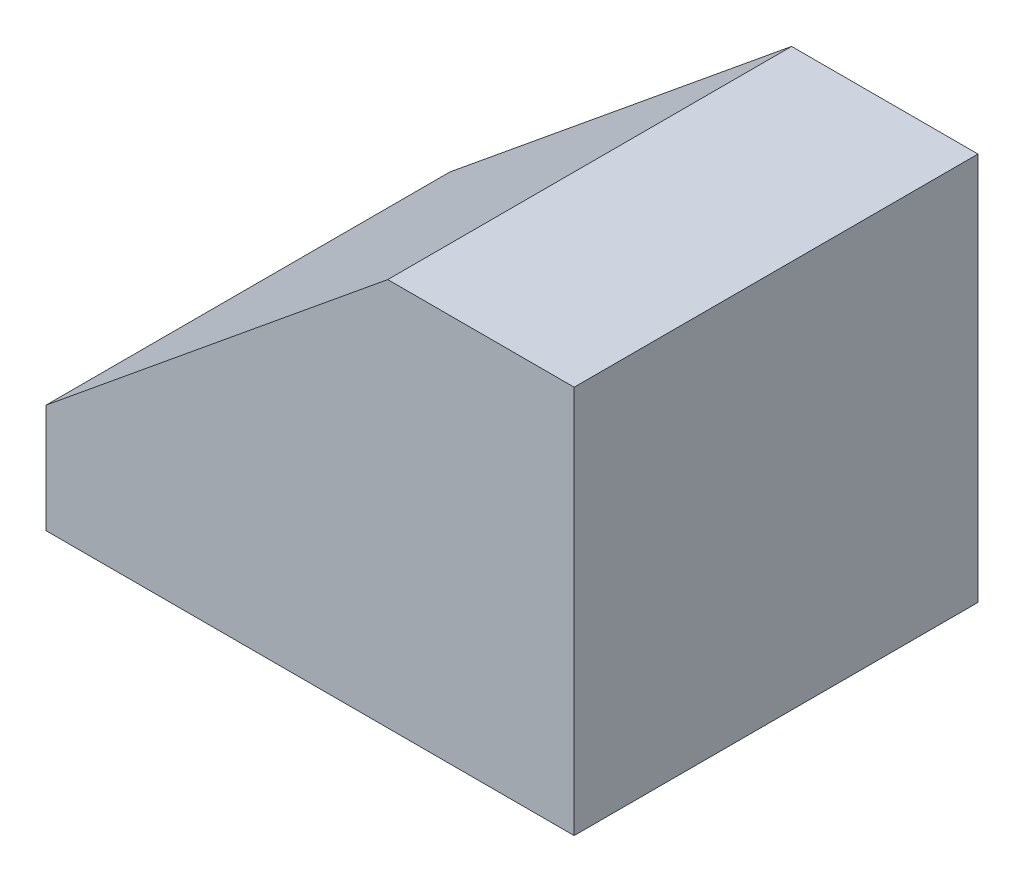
ISO-10303-21;
HEADER;
FILE_DESCRIPTION(('STEP AP214'),'2;1');
FILE_NAME('part.step','',(''),(''),'','','');
FILE_SCHEMA(('AUTOMOTIVE_DESIGN { 1 0 10303 214 1 1 1 1 }'));
ENDSEC;
DATA;
#1=APPLICATION_CONTEXT('core data for automotive mechanical design processes');
#2=APPLICATION_PROTOCOL_DEFINITION('international standard','automotive_design',2000,#1);
#3=PRODUCT_CONTEXT('',#1,'mechanical');
#4=PRODUCT('Part','Part','',(#3));
#5=PRODUCT_RELATED_PRODUCT_CATEGORY('part','',(#4));
#6=PRODUCT_DEFINITION_FORMATION('','',#4);
#7=PRODUCT_DEFINITION_CONTEXT('part definition',#1,'design');
#8=PRODUCT_DEFINITION('design','',#6,#7);
#9=PRODUCT_DEFINITION_SHAPE('','',#8);
#10=(LENGTH_UNIT() NAMED_UNIT(*) SI_UNIT(.MILLI.,.METRE.));
#11=(NAMED_UNIT(*) PLANE_ANGLE_UNIT() SI_UNIT($,.RADIAN.));
#12=(NAMED_UNIT(*) SI_UNIT($,.STERADIAN.) SOLID_ANGLE_UNIT());
#13=UNCERTAINTY_MEASURE_WITH_UNIT(LENGTH_MEASURE(1.E-05),#10,'distance_accuracy_value','');
#14=(GEOMETRIC_REPRESENTATION_CONTEXT(3) GLOBAL_UNCERTAINTY_ASSIGNED_CONTEXT((#13)) GLOBAL_UNIT_ASSIGNED_CONTEXT((#10,
#11,#12)) REPRESENTATION_CONTEXT('',''));
#15=CARTESIAN_POINT('',(0.,0.,0.));
#16=DIRECTION('',(0.,0.,1.));
#17=DIRECTION('',(1.,0.,0.));
#18=AXIS2_PLACEMENT_3D('',#15,#16,#17);
#19=CARTESIAN_POINT('',(0.,50.,0.));
#20=DIRECTION('',(0.,0.,1.));
#21=DIRECTION('',(1.,0.,0.));
#22=AXIS2_PLACEMENT_3D('',#19,#20,#21);
#23=PLANE('',#22);
#24=DIRECTION('',(0.773957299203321,0.633237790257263,0.));
#25=VECTOR('',#24,1.);
#26=CARTESIAN_POINT('',(-24.,50.,0.));
#27=LINE('',#26,#25);
#28=CARTESIAN_POINT('',(-68.,14.,0.));
#29=VERTEX_POINT('',#28);
#30=CARTESIAN_POINT('',(-24.,50.,0.));
#31=VERTEX_POINT('',#30);
#32=EDGE_CURVE('E115',#29,#31,#27,.T.);
#33=ORIENTED_EDGE('',*,*,#32,.T.);
#34=DIRECTION('',(-1.,0.,0.));
#35=VECTOR('',#34,1.);
#36=CARTESIAN_POINT('',(0.,50.,0.));
#37=LINE('',#36,#35);
#38=CARTESIAN_POINT('',(0.,50.,0.));
#39=VERTEX_POINT('',#38);
#40=EDGE_CURVE('E112',#39,#31,#37,.T.);
#41=ORIENTED_EDGE('',*,*,#40,.F.);
#42=DIRECTION('',(0.,-1.,0.));
#43=VECTOR('',#42,1.);
#44=CARTESIAN_POINT('',(0.,50.,0.));
#45=LINE('',#44,#43);
#46=CARTESIAN_POINT('',(0.,0.,0.));
#47=VERTEX_POINT('',#46);
#48=EDGE_CURVE('E11',#39,#47,#45,.T.);
#49=ORIENTED_EDGE('',*,*,#48,.T.);
#50=DIRECTION('',(-1.,0.,0.));
#51=VECTOR('',#50,1.);
#52=CARTESIAN_POINT('',(0.,0.,0.));
#53=LINE('',#52,#51);
#54=CARTESIAN_POINT('',(-68.,0.,0.));
#55=VERTEX_POINT('',#54);
#56=EDGE_CURVE('E94',#47,#55,#53,.T.);
#57=ORIENTED_EDGE('',*,*,#56,.T.);
#58=DIRECTION('',(0.,-1.,0.));
#59=VECTOR('',#58,1.);
#60=CARTESIAN_POINT('',(-68.,50.,0.));
#61=LINE('',#60,#59);
#62=EDGE_CURVE('E39',#29,#55,#61,.T.);
#63=ORIENTED_EDGE('',*,*,#62,.F.);
#64=EDGE_LOOP('',(#33,#41,#49,#57,#63));
#65=FACE_BOUND('',#64,.T.);
#66=ADVANCED_FACE('F31',(#65),#23,.F.);
#67=CARTESIAN_POINT('',(-68.,50.,0.));
#68=DIRECTION('',(1.,0.,0.));
#69=DIRECTION('',(0.,0.,-1.));
#70=AXIS2_PLACEMENT_3D('',#67,#68,#69);
#71=PLANE('',#70);
#72=DIRECTION('',(0.,0.,-1.));
#73=VECTOR('',#72,1.);
#74=CARTESIAN_POINT('',(-68.,14.,52.));
#75=LINE('',#74,#73);
#76=CARTESIAN_POINT('',(-68.,14.,52.));
#77=VERTEX_POINT('',#76);
#78=EDGE_CURVE('E95',#77,#29,#75,.T.);
#79=ORIENTED_EDGE('',*,*,#78,.T.);
#80=ORIENTED_EDGE('',*,*,#62,.T.);
#81=DIRECTION('',(0.,0.,1.));
#82=VECTOR('',#81,1.);
#83=CARTESIAN_POINT('',(-68.,0.,0.));
#84=LINE('',#83,#82);
#85=CARTESIAN_POINT('',(-68.,0.,52.));
#86=VERTEX_POINT('',#85);
#87=EDGE_CURVE('E85',#55,#86,#84,.T.);
#88=ORIENTED_EDGE('',*,*,#87,.T.);
#89=DIRECTION('',(0.,-1.,0.));
#90=VECTOR('',#89,1.);
#91=CARTESIAN_POINT('',(-68.,50.,52.));
#92=LINE('',#91,#90);
#93=EDGE_CURVE('E79',#77,#86,#92,.T.);
#94=ORIENTED_EDGE('',*,*,#93,.F.);
#95=EDGE_LOOP('',(#79,#80,#88,#94));
#96=FACE_BOUND('',#95,.T.);
#97=ADVANCED_FACE('F107',(#96),#71,.F.);
#98=CARTESIAN_POINT('',(-68.,50.,52.));
#99=DIRECTION('',(0.,0.,-1.));
#100=DIRECTION('',(-1.,0.,0.));
#101=AXIS2_PLACEMENT_3D('',#98,#99,#100);
#102=PLANE('',#101);
#103=DIRECTION('',(0.773957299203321,0.633237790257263,0.));
#104=VECTOR('',#103,1.);
#105=CARTESIAN_POINT('',(-24.,50.,52.));
#106=LINE('',#105,#104);
#107=CARTESIAN_POINT('',(-24.,50.,52.));
#108=VERTEX_POINT('',#107);
#109=EDGE_CURVE('E46',#77,#108,#106,.T.);
#110=ORIENTED_EDGE('',*,*,#109,.F.);
#111=ORIENTED_EDGE('',*,*,#93,.T.);
#112=DIRECTION('',(1.,0.,0.));
#113=VECTOR('',#112,1.);
#114=CARTESIAN_POINT('',(-68.,0.,52.));
#115=LINE('',#114,#113);
#116=CARTESIAN_POINT('',(0.,0.,52.));
#117=VERTEX_POINT('',#116);
#118=EDGE_CURVE('E73',#86,#117,#115,.T.);
#119=ORIENTED_EDGE('',*,*,#118,.T.);
#120=DIRECTION('',(0.,-1.,0.));
#121=VECTOR('',#120,1.);
#122=CARTESIAN_POINT('',(0.,50.,52.));
#123=LINE('',#122,#121);
#124=CARTESIAN_POINT('',(0.,50.,52.));
#125=VERTEX_POINT('',#124);
#126=EDGE_CURVE('E76',#125,#117,#123,.T.);
#127=ORIENTED_EDGE('',*,*,#126,.F.);
#128=DIRECTION('',(1.,0.,0.));
#129=VECTOR('',#128,1.);
#130=CARTESIAN_POINT('',(-68.,50.,52.));
#131=LINE('',#130,#129);
#132=EDGE_CURVE('E54',#108,#125,#131,.T.);
#133=ORIENTED_EDGE('',*,*,#132,.F.);
#134=EDGE_LOOP('',(#110,#111,#119,#127,#133));
#135=FACE_BOUND('',#134,.T.);
#136=ADVANCED_FACE('F75',(#135),#102,.F.);
#137=CARTESIAN_POINT('',(0.,50.,0.));
#138=DIRECTION('',(0.,1.,0.));
#139=DIRECTION('',(0.,0.,1.));
#140=AXIS2_PLACEMENT_3D('',#137,#138,#139);
#141=PLANE('',#140);
#142=ORIENTED_EDGE('',*,*,#40,.T.);
#143=DIRECTION('',(0.,0.,-1.));
#144=VECTOR('',#143,1.);
#145=CARTESIAN_POINT('',(-24.,50.,52.));
#146=LINE('',#145,#144);
#147=EDGE_CURVE('E99',#108,#31,#146,.T.);
#148=ORIENTED_EDGE('',*,*,#147,.F.);
#149=ORIENTED_EDGE('',*,*,#132,.T.);
#150=DIRECTION('',(0.,0.,-1.));
#151=VECTOR('',#150,1.);
#152=CARTESIAN_POINT('',(0.,50.,52.));
#153=LINE('',#152,#151);
#154=EDGE_CURVE('E84',#125,#39,#153,.T.);
#155=ORIENTED_EDGE('',*,*,#154,.T.);
#156=EDGE_LOOP('',(#142,#148,#149,#155));
#157=FACE_BOUND('',#156,.T.);
#158=ADVANCED_FACE('F116',(#157),#141,.T.);
#159=CARTESIAN_POINT('',(0.,50.,52.));
#160=DIRECTION('',(-1.,0.,0.));
#161=DIRECTION('',(0.,0.,1.));
#162=AXIS2_PLACEMENT_3D('',#159,#160,#161);
#163=PLANE('',#162);
#164=DIRECTION('',(0.,0.,-1.));
#165=VECTOR('',#164,1.);
#166=CARTESIAN_POINT('',(0.,0.,52.));
#167=LINE('',#166,#165);
#168=EDGE_CURVE('E90',#117,#47,#167,.T.);
#169=ORIENTED_EDGE('',*,*,#168,.T.);
#170=ORIENTED_EDGE('',*,*,#48,.F.);
#171=ORIENTED_EDGE('',*,*,#154,.F.);
#172=ORIENTED_EDGE('',*,*,#126,.T.);
#173=EDGE_LOOP('',(#169,#170,#171,#172));
#174=FACE_BOUND('',#173,.T.);
#175=ADVANCED_FACE('F33',(#174),#163,.F.);
#176=CARTESIAN_POINT('',(0.,0.,0.));
#177=DIRECTION('',(0.,1.,0.));
#178=DIRECTION('',(0.,0.,1.));
#179=AXIS2_PLACEMENT_3D('',#176,#177,#178);
#180=PLANE('',#179);
#181=ORIENTED_EDGE('',*,*,#168,.F.);
#182=ORIENTED_EDGE('',*,*,#118,.F.);
#183=ORIENTED_EDGE('',*,*,#87,.F.);
#184=ORIENTED_EDGE('',*,*,#56,.F.);
#185=EDGE_LOOP('',(#181,#182,#183,#184));
#186=FACE_BOUND('',#185,.T.);
#187=ADVANCED_FACE('F92',(#186),#180,.F.);
#188=CARTESIAN_POINT('',(-24.,50.,52.));
#189=DIRECTION('',(-0.633237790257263,0.773957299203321,0.));
#190=DIRECTION('',(-0.773957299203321,-0.633237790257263,0.));
#191=AXIS2_PLACEMENT_3D('',#188,#189,#190);
#192=PLANE('',#191);
#193=ORIENTED_EDGE('',*,*,#32,.F.);
#194=ORIENTED_EDGE('',*,*,#78,.F.);
#195=ORIENTED_EDGE('',*,*,#109,.T.);
#196=ORIENTED_EDGE('',*,*,#147,.T.);
#197=EDGE_LOOP('',(#193,#194,#195,#196));
#198=FACE_BOUND('',#197,.T.);
#199=ADVANCED_FACE('F121',(#198),#192,.T.);
#200=CLOSED_SHELL('',(#66,#97,#136,#158,#175,#187,#199));
#201=MANIFOLD_SOLID_BREP('B2',#200);
#202=ADVANCED_BREP_SHAPE_REPRESENTATION('',(#18,#201),#14);
#203=SHAPE_DEFINITION_REPRESENTATION(#9,#202);
ENDSEC;
END-ISO-10303-21;
